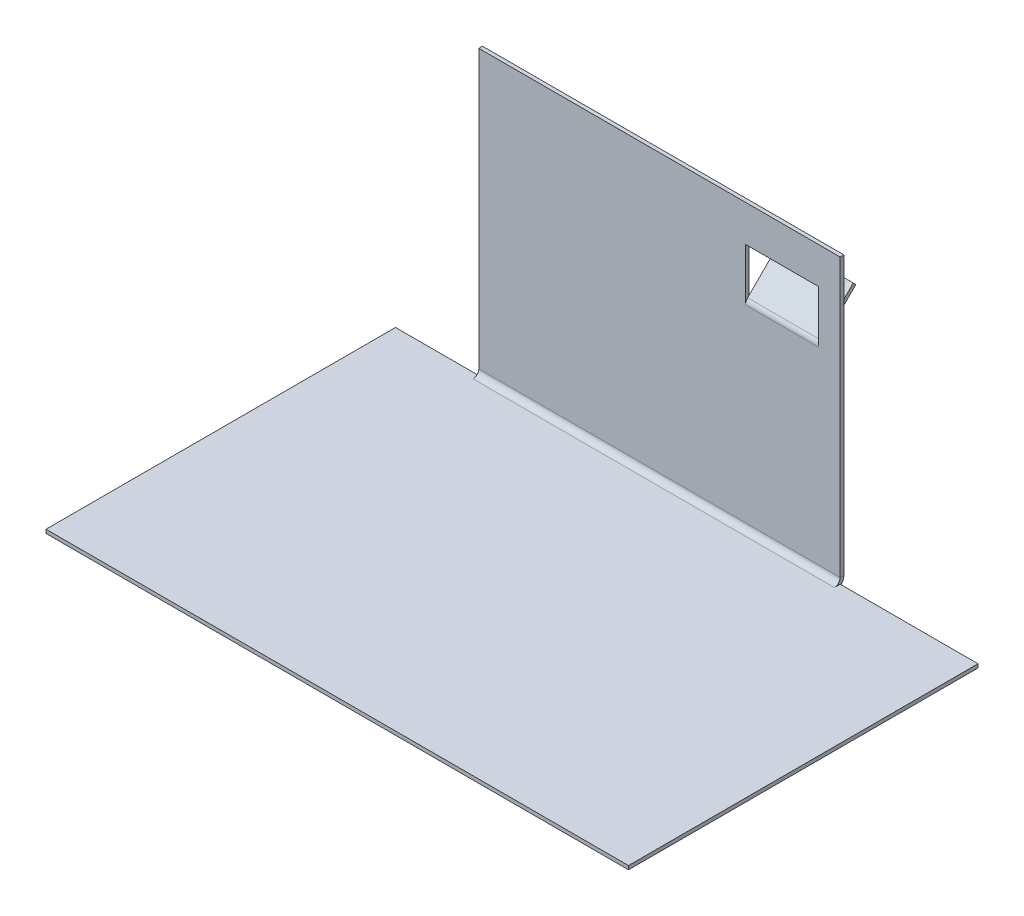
ISO-10303-21;
HEADER;
FILE_DESCRIPTION(('STEP AP214'),'2;1');
FILE_NAME('part.step','',(''),(''),'','','');
FILE_SCHEMA(('AUTOMOTIVE_DESIGN { 1 0 10303 214 1 1 1 1 }'));
ENDSEC;
DATA;
#1=APPLICATION_CONTEXT('core data for automotive mechanical design processes');
#2=APPLICATION_PROTOCOL_DEFINITION('international standard','automotive_design',2000,#1);
#3=PRODUCT_CONTEXT('',#1,'mechanical');
#4=PRODUCT('Part','Part','',(#3));
#5=PRODUCT_RELATED_PRODUCT_CATEGORY('part','',(#4));
#6=PRODUCT_DEFINITION_FORMATION('','',#4);
#7=PRODUCT_DEFINITION_CONTEXT('part definition',#1,'design');
#8=PRODUCT_DEFINITION('design','',#6,#7);
#9=PRODUCT_DEFINITION_SHAPE('','',#8);
#10=(LENGTH_UNIT() NAMED_UNIT(*) SI_UNIT(.MILLI.,.METRE.));
#11=(NAMED_UNIT(*) PLANE_ANGLE_UNIT() SI_UNIT($,.RADIAN.));
#12=(NAMED_UNIT(*) SI_UNIT($,.STERADIAN.) SOLID_ANGLE_UNIT());
#13=UNCERTAINTY_MEASURE_WITH_UNIT(LENGTH_MEASURE(1.E-05),#10,'distance_accuracy_value','');
#14=(GEOMETRIC_REPRESENTATION_CONTEXT(3) GLOBAL_UNCERTAINTY_ASSIGNED_CONTEXT((#13)) GLOBAL_UNIT_ASSIGNED_CONTEXT((#10,
#11,#12)) REPRESENTATION_CONTEXT('',''));
#15=CARTESIAN_POINT('',(0.,0.,0.));
#16=DIRECTION('',(0.,0.,1.));
#17=DIRECTION('',(1.,0.,0.));
#18=AXIS2_PLACEMENT_3D('',#15,#16,#17);
#19=CARTESIAN_POINT('',(0.,-4.15217400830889E-13,-121.27));
#20=DIRECTION('',(0.,0.,1.));
#21=DIRECTION('',(0.,-1.,0.));
#22=AXIS2_PLACEMENT_3D('',#19,#20,#21);
#23=PLANE('',#22);
#24=DIRECTION('',(1.,0.,0.));
#25=VECTOR('',#24,1.);
#26=CARTESIAN_POINT('',(0.,2.,-121.27));
#27=LINE('',#26,#25);
#28=CARTESIAN_POINT('',(28.5988548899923,2.,-121.27));
#29=VERTEX_POINT('',#28);
#30=CARTESIAN_POINT('',(152.672536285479,1.99999999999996,-121.27));
#31=VERTEX_POINT('',#30);
#32=EDGE_CURVE('E258',#29,#31,#27,.T.);
#33=ORIENTED_EDGE('',*,*,#32,.F.);
#34=DIRECTION('',(0.,1.,0.));
#35=VECTOR('',#34,1.);
#36=CARTESIAN_POINT('',(28.5988548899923,97.2971313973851,-121.27));
#37=LINE('',#36,#35);
#38=CARTESIAN_POINT('',(28.5988548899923,97.2971313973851,-121.27));
#39=VERTEX_POINT('',#38);
#40=EDGE_CURVE('E267',#29,#39,#37,.T.);
#41=ORIENTED_EDGE('',*,*,#40,.T.);
#42=DIRECTION('',(1.,0.,0.));
#43=VECTOR('',#42,1.);
#44=CARTESIAN_POINT('',(152.672536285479,97.2971313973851,-121.27));
#45=LINE('',#44,#43);
#46=CARTESIAN_POINT('',(152.672536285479,97.2971313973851,-121.27));
#47=VERTEX_POINT('',#46);
#48=EDGE_CURVE('E270',#39,#47,#45,.T.);
#49=ORIENTED_EDGE('',*,*,#48,.T.);
#50=DIRECTION('',(0.,-1.,0.));
#51=VECTOR('',#50,1.);
#52=CARTESIAN_POINT('',(152.672536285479,0.,-121.27));
#53=LINE('',#52,#51);
#54=EDGE_CURVE('E264',#47,#31,#53,.T.);
#55=ORIENTED_EDGE('',*,*,#54,.T.);
#56=EDGE_LOOP('',(#33,#41,#49,#55));
#57=FACE_BOUND('',#56,.T.);
#58=DIRECTION('',(0.,-1.,0.));
#59=VECTOR('',#58,1.);
#60=CARTESIAN_POINT('',(145.17253628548,-4.15217400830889E-13,-121.27));
#61=LINE('',#60,#59);
#62=CARTESIAN_POINT('',(145.17253628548,69.0818500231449,-121.27));
#63=VERTEX_POINT('',#62);
#64=CARTESIAN_POINT('',(145.17253628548,66.7763161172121,-121.27));
#65=VERTEX_POINT('',#64);
#66=EDGE_CURVE('E215',#63,#65,#61,.T.);
#67=ORIENTED_EDGE('',*,*,#66,.F.);
#68=DIRECTION('',(0.,1.,0.));
#69=VECTOR('',#68,1.);
#70=CARTESIAN_POINT('',(145.17253628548,-4.15217400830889E-13,-121.27));
#71=LINE('',#70,#69);
#72=CARTESIAN_POINT('',(145.17253628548,84.782412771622,-121.27));
#73=VERTEX_POINT('',#72);
#74=EDGE_CURVE('E244',#63,#73,#71,.T.);
#75=ORIENTED_EDGE('',*,*,#74,.T.);
#76=DIRECTION('',(-1.,0.,0.));
#77=VECTOR('',#76,1.);
#78=CARTESIAN_POINT('',(0.,84.782412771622,-121.27));
#79=LINE('',#78,#77);
#80=CARTESIAN_POINT('',(120.17253628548,84.782412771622,-121.27));
#81=VERTEX_POINT('',#80);
#82=EDGE_CURVE('E249',#73,#81,#79,.T.);
#83=ORIENTED_EDGE('',*,*,#82,.T.);
#84=DIRECTION('',(0.,1.,0.));
#85=VECTOR('',#84,1.);
#86=CARTESIAN_POINT('',(120.17253628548,-4.15217400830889E-13,-121.27));
#87=LINE('',#86,#85);
#88=CARTESIAN_POINT('',(120.17253628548,69.0818500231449,-121.27));
#89=VERTEX_POINT('',#88);
#90=EDGE_CURVE('E247',#89,#81,#87,.T.);
#91=ORIENTED_EDGE('',*,*,#90,.F.);
#92=DIRECTION('',(0.,-1.,0.));
#93=VECTOR('',#92,1.);
#94=CARTESIAN_POINT('',(120.17253628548,-4.15217400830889E-13,-121.27));
#95=LINE('',#94,#93);
#96=CARTESIAN_POINT('',(120.17253628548,66.7763161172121,-121.27));
#97=VERTEX_POINT('',#96);
#98=EDGE_CURVE('E195',#97,#89,#95,.F.);
#99=ORIENTED_EDGE('',*,*,#98,.F.);
#100=DIRECTION('',(-1.,0.,0.));
#101=VECTOR('',#100,1.);
#102=CARTESIAN_POINT('',(107.67253628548,66.7763161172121,-121.27));
#103=LINE('',#102,#101);
#104=EDGE_CURVE('E53',#97,#65,#103,.F.);
#105=ORIENTED_EDGE('',*,*,#104,.T.);
#106=EDGE_LOOP('',(#67,#75,#83,#91,#99,#105));
#107=FACE_BOUND('',#106,.T.);
#108=ADVANCED_FACE('F35',(#57,#107),#23,.F.);
#109=CARTESIAN_POINT('',(28.5988548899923,0.,-120.));
#110=DIRECTION('',(1.,0.,0.));
#111=DIRECTION('',(0.,0.,-1.));
#112=AXIS2_PLACEMENT_3D('',#109,#110,#111);
#113=PLANE('',#112);
#114=DIRECTION('',(0.,-1.,0.));
#115=VECTOR('',#114,1.);
#116=CARTESIAN_POINT('',(28.5988548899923,0.,-120.));
#117=LINE('',#116,#115);
#118=CARTESIAN_POINT('',(28.5988548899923,-0.587063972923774,-120.));
#119=VERTEX_POINT('',#118);
#120=CARTESIAN_POINT('',(28.5988548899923,-1.27,-120.));
#121=VERTEX_POINT('',#120);
#122=EDGE_CURVE('E311',#119,#121,#117,.T.);
#123=ORIENTED_EDGE('',*,*,#122,.F.);
#124=CARTESIAN_POINT('',(28.5988548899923,1.99999999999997,-118.));
#125=DIRECTION('',(-1.,0.,0.));
#126=DIRECTION('',(0.,0.,1.));
#127=AXIS2_PLACEMENT_3D('',#124,#125,#126);
#128=CIRCLE('',#127,3.27);
#129=CARTESIAN_POINT('',(28.5988548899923,-1.27,-118.));
#130=VERTEX_POINT('',#129);
#131=EDGE_CURVE('E12',#119,#130,#128,.T.);
#132=ORIENTED_EDGE('',*,*,#131,.T.);
#133=DIRECTION('',(0.,0.,1.));
#134=VECTOR('',#133,1.);
#135=CARTESIAN_POINT('',(28.5988548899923,-1.27,0.));
#136=LINE('',#135,#134);
#137=EDGE_CURVE('E316',#121,#130,#136,.T.);
#138=ORIENTED_EDGE('',*,*,#137,.F.);
#139=EDGE_LOOP('',(#123,#132,#138));
#140=FACE_BOUND('',#139,.T.);
#141=ADVANCED_FACE('F410',(#140),#113,.T.);
#142=CARTESIAN_POINT('',(152.672536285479,0.,-118.));
#143=DIRECTION('',(-1.,0.,0.));
#144=DIRECTION('',(0.,0.,1.));
#145=AXIS2_PLACEMENT_3D('',#142,#143,#144);
#146=PLANE('',#145);
#147=DIRECTION('',(0.,0.,-1.));
#148=VECTOR('',#147,1.);
#149=CARTESIAN_POINT('',(152.672536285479,-1.27,0.));
#150=LINE('',#149,#148);
#151=CARTESIAN_POINT('',(152.672536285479,-1.27,-118.));
#152=VERTEX_POINT('',#151);
#153=CARTESIAN_POINT('',(152.672536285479,-1.27,-120.));
#154=VERTEX_POINT('',#153);
#155=EDGE_CURVE('E303',#152,#154,#150,.T.);
#156=ORIENTED_EDGE('',*,*,#155,.F.);
#157=CARTESIAN_POINT('',(152.672536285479,1.99999999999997,-118.));
#158=DIRECTION('',(-1.,0.,0.));
#159=DIRECTION('',(0.,0.,1.));
#160=AXIS2_PLACEMENT_3D('',#157,#158,#159);
#161=CIRCLE('',#160,3.27);
#162=CARTESIAN_POINT('',(152.672536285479,-0.587063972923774,-120.));
#163=VERTEX_POINT('',#162);
#164=EDGE_CURVE('E287',#152,#163,#161,.F.);
#165=ORIENTED_EDGE('',*,*,#164,.T.);
#166=DIRECTION('',(0.,-1.,0.));
#167=VECTOR('',#166,1.);
#168=CARTESIAN_POINT('',(152.672536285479,0.,-120.));
#169=LINE('',#168,#167);
#170=EDGE_CURVE('E307',#163,#154,#169,.T.);
#171=ORIENTED_EDGE('',*,*,#170,.T.);
#172=EDGE_LOOP('',(#156,#165,#171));
#173=FACE_BOUND('',#172,.T.);
#174=ADVANCED_FACE('F413',(#173),#146,.T.);
#175=CARTESIAN_POINT('',(0.,-1.27,-120.));
#176=DIRECTION('',(0.,0.,-1.));
#177=DIRECTION('',(-1.,0.,0.));
#178=AXIS2_PLACEMENT_3D('',#175,#176,#177);
#179=PLANE('',#178);
#180=DIRECTION('',(-1.,0.,0.));
#181=VECTOR('',#180,1.);
#182=CARTESIAN_POINT('',(0.,0.,-120.));
#183=LINE('',#182,#181);
#184=CARTESIAN_POINT('',(28.5988548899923,0.,-120.));
#185=VERTEX_POINT('',#184);
#186=CARTESIAN_POINT('',(0.,0.,-120.));
#187=VERTEX_POINT('',#186);
#188=EDGE_CURVE('E342',#185,#187,#183,.T.);
#189=ORIENTED_EDGE('',*,*,#188,.F.);
#190=EDGE_CURVE('E304',#185,#119,#117,.T.);
#191=ORIENTED_EDGE('',*,*,#190,.T.);
#192=ORIENTED_EDGE('',*,*,#122,.T.);
#193=DIRECTION('',(-1.,0.,0.));
#194=VECTOR('',#193,1.);
#195=CARTESIAN_POINT('',(0.,-1.27,-120.));
#196=LINE('',#195,#194);
#197=CARTESIAN_POINT('',(0.,-1.27,-120.));
#198=VERTEX_POINT('',#197);
#199=EDGE_CURVE('E330',#121,#198,#196,.T.);
#200=ORIENTED_EDGE('',*,*,#199,.T.);
#201=DIRECTION('',(0.,1.,0.));
#202=VECTOR('',#201,1.);
#203=CARTESIAN_POINT('',(0.,-1.27,-120.));
#204=LINE('',#203,#202);
#205=EDGE_CURVE('E44',#198,#187,#204,.T.);
#206=ORIENTED_EDGE('',*,*,#205,.T.);
#207=EDGE_LOOP('',(#189,#191,#192,#200,#206));
#208=FACE_BOUND('',#207,.T.);
#209=ADVANCED_FACE('F362',(#208),#179,.T.);
#210=CARTESIAN_POINT('',(200.,-1.27,-120.));
#211=VERTEX_POINT('',#210);
#212=EDGE_CURVE('E331',#211,#154,#196,.T.);
#213=ORIENTED_EDGE('',*,*,#212,.T.);
#214=ORIENTED_EDGE('',*,*,#170,.F.);
#215=CARTESIAN_POINT('',(152.672536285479,0.,-120.));
#216=VERTEX_POINT('',#215);
#217=EDGE_CURVE('E308',#216,#163,#169,.T.);
#218=ORIENTED_EDGE('',*,*,#217,.F.);
#219=CARTESIAN_POINT('',(200.,0.,-120.));
#220=VERTEX_POINT('',#219);
#221=EDGE_CURVE('E324',#220,#216,#183,.T.);
#222=ORIENTED_EDGE('',*,*,#221,.F.);
#223=DIRECTION('',(0.,1.,0.));
#224=VECTOR('',#223,1.);
#225=CARTESIAN_POINT('',(200.,-1.27,-120.));
#226=LINE('',#225,#224);
#227=EDGE_CURVE('E346',#211,#220,#226,.T.);
#228=ORIENTED_EDGE('',*,*,#227,.F.);
#229=EDGE_LOOP('',(#213,#214,#218,#222,#228));
#230=FACE_BOUND('',#229,.T.);
#231=ADVANCED_FACE('F374',(#230),#179,.T.);
#232=CARTESIAN_POINT('',(0.,-1.27,0.));
#233=DIRECTION('',(0.,-1.,0.));
#234=DIRECTION('',(0.,0.,-1.));
#235=AXIS2_PLACEMENT_3D('',#232,#233,#234);
#236=PLANE('',#235);
#237=ORIENTED_EDGE('',*,*,#199,.F.);
#238=ORIENTED_EDGE('',*,*,#137,.T.);
#239=DIRECTION('',(-1.,0.,0.));
#240=VECTOR('',#239,1.);
#241=CARTESIAN_POINT('',(28.5988548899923,-1.27000000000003,-118.));
#242=LINE('',#241,#240);
#243=EDGE_CURVE('E284',#130,#152,#242,.F.);
#244=ORIENTED_EDGE('',*,*,#243,.T.);
#245=ORIENTED_EDGE('',*,*,#155,.T.);
#246=ORIENTED_EDGE('',*,*,#212,.F.);
#247=DIRECTION('',(0.,0.,-1.));
#248=VECTOR('',#247,1.);
#249=CARTESIAN_POINT('',(200.,-1.27,0.));
#250=LINE('',#249,#248);
#251=CARTESIAN_POINT('',(200.,-1.27,0.));
#252=VERTEX_POINT('',#251);
#253=EDGE_CURVE('E327',#252,#211,#250,.T.);
#254=ORIENTED_EDGE('',*,*,#253,.F.);
#255=DIRECTION('',(1.,0.,0.));
#256=VECTOR('',#255,1.);
#257=CARTESIAN_POINT('',(0.,-1.27,0.));
#258=LINE('',#257,#256);
#259=CARTESIAN_POINT('',(0.,-1.27,0.));
#260=VERTEX_POINT('',#259);
#261=EDGE_CURVE('E323',#260,#252,#258,.T.);
#262=ORIENTED_EDGE('',*,*,#261,.F.);
#263=DIRECTION('',(0.,0.,1.));
#264=VECTOR('',#263,1.);
#265=CARTESIAN_POINT('',(0.,-1.27,0.));
#266=LINE('',#265,#264);
#267=EDGE_CURVE('E320',#198,#260,#266,.T.);
#268=ORIENTED_EDGE('',*,*,#267,.F.);
#269=EDGE_LOOP('',(#237,#238,#244,#245,#246,#254,#262,#268));
#270=FACE_BOUND('',#269,.T.);
#271=ADVANCED_FACE('F365',(#270),#236,.T.);
#272=CARTESIAN_POINT('',(0.,0.,0.));
#273=DIRECTION('',(0.,-1.,0.));
#274=DIRECTION('',(0.,0.,-1.));
#275=AXIS2_PLACEMENT_3D('',#272,#273,#274);
#276=PLANE('',#275);
#277=DIRECTION('',(0.,0.,1.));
#278=VECTOR('',#277,1.);
#279=CARTESIAN_POINT('',(28.5988548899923,0.,-120.));
#280=LINE('',#279,#278);
#281=CARTESIAN_POINT('',(28.5988548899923,0.,-118.));
#282=VERTEX_POINT('',#281);
#283=EDGE_CURVE('E300',#185,#282,#280,.T.);
#284=ORIENTED_EDGE('',*,*,#283,.F.);
#285=ORIENTED_EDGE('',*,*,#188,.T.);
#286=DIRECTION('',(0.,0.,1.));
#287=VECTOR('',#286,1.);
#288=CARTESIAN_POINT('',(0.,0.,0.));
#289=LINE('',#288,#287);
#290=CARTESIAN_POINT('',(0.,0.,0.));
#291=VERTEX_POINT('',#290);
#292=EDGE_CURVE('E319',#187,#291,#289,.T.);
#293=ORIENTED_EDGE('',*,*,#292,.T.);
#294=DIRECTION('',(1.,0.,0.));
#295=VECTOR('',#294,1.);
#296=CARTESIAN_POINT('',(0.,0.,0.));
#297=LINE('',#296,#295);
#298=CARTESIAN_POINT('',(200.,0.,0.));
#299=VERTEX_POINT('',#298);
#300=EDGE_CURVE('E336',#291,#299,#297,.T.);
#301=ORIENTED_EDGE('',*,*,#300,.T.);
#302=DIRECTION('',(0.,0.,-1.));
#303=VECTOR('',#302,1.);
#304=CARTESIAN_POINT('',(200.,0.,0.));
#305=LINE('',#304,#303);
#306=EDGE_CURVE('E339',#299,#220,#305,.T.);
#307=ORIENTED_EDGE('',*,*,#306,.T.);
#308=ORIENTED_EDGE('',*,*,#221,.T.);
#309=DIRECTION('',(0.,0.,-1.));
#310=VECTOR('',#309,1.);
#311=CARTESIAN_POINT('',(152.672536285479,0.,-118.));
#312=LINE('',#311,#310);
#313=CARTESIAN_POINT('',(152.672536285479,0.,-118.));
#314=VERTEX_POINT('',#313);
#315=EDGE_CURVE('E289',#314,#216,#312,.T.);
#316=ORIENTED_EDGE('',*,*,#315,.F.);
#317=DIRECTION('',(-1.,0.,0.));
#318=VECTOR('',#317,1.);
#319=CARTESIAN_POINT('',(28.5988548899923,0.,-118.));
#320=LINE('',#319,#318);
#321=EDGE_CURVE('E295',#282,#314,#320,.F.);
#322=ORIENTED_EDGE('',*,*,#321,.F.);
#323=EDGE_LOOP('',(#284,#285,#293,#301,#307,#308,#316,#322));
#324=FACE_BOUND('',#323,.T.);
#325=ADVANCED_FACE('F358',(#324),#276,.F.);
#326=CARTESIAN_POINT('',(0.,-1.27,0.));
#327=DIRECTION('',(-1.,0.,0.));
#328=DIRECTION('',(0.,0.,1.));
#329=AXIS2_PLACEMENT_3D('',#326,#327,#328);
#330=PLANE('',#329);
#331=ORIENTED_EDGE('',*,*,#292,.F.);
#332=ORIENTED_EDGE('',*,*,#205,.F.);
#333=ORIENTED_EDGE('',*,*,#267,.T.);
#334=DIRECTION('',(0.,1.,0.));
#335=VECTOR('',#334,1.);
#336=CARTESIAN_POINT('',(0.,-1.27,0.));
#337=LINE('',#336,#335);
#338=EDGE_CURVE('E39',#260,#291,#337,.T.);
#339=ORIENTED_EDGE('',*,*,#338,.T.);
#340=EDGE_LOOP('',(#331,#332,#333,#339));
#341=FACE_BOUND('',#340,.T.);
#342=ADVANCED_FACE('F37',(#341),#330,.T.);
#343=CARTESIAN_POINT('',(200.,-1.27,0.));
#344=DIRECTION('',(1.,0.,0.));
#345=DIRECTION('',(0.,0.,-1.));
#346=AXIS2_PLACEMENT_3D('',#343,#344,#345);
#347=PLANE('',#346);
#348=ORIENTED_EDGE('',*,*,#306,.F.);
#349=DIRECTION('',(0.,1.,0.));
#350=VECTOR('',#349,1.);
#351=CARTESIAN_POINT('',(200.,-1.27,0.));
#352=LINE('',#351,#350);
#353=EDGE_CURVE('E347',#252,#299,#352,.T.);
#354=ORIENTED_EDGE('',*,*,#353,.F.);
#355=ORIENTED_EDGE('',*,*,#253,.T.);
#356=ORIENTED_EDGE('',*,*,#227,.T.);
#357=EDGE_LOOP('',(#348,#354,#355,#356));
#358=FACE_BOUND('',#357,.T.);
#359=ADVANCED_FACE('F370',(#358),#347,.T.);
#360=CARTESIAN_POINT('',(0.,-1.27,0.));
#361=DIRECTION('',(0.,0.,1.));
#362=DIRECTION('',(1.,0.,0.));
#363=AXIS2_PLACEMENT_3D('',#360,#361,#362);
#364=PLANE('',#363);
#365=ORIENTED_EDGE('',*,*,#300,.F.);
#366=ORIENTED_EDGE('',*,*,#338,.F.);
#367=ORIENTED_EDGE('',*,*,#261,.T.);
#368=ORIENTED_EDGE('',*,*,#353,.T.);
#369=EDGE_LOOP('',(#365,#366,#367,#368));
#370=FACE_BOUND('',#369,.T.);
#371=ADVANCED_FACE('F356',(#370),#364,.T.);
#372=CARTESIAN_POINT('',(28.5988548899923,1.99999999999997,-118.));
#373=DIRECTION('',(1.,0.,0.));
#374=DIRECTION('',(0.,0.,-1.));
#375=AXIS2_PLACEMENT_3D('',#372,#373,#374);
#376=PLANE('',#375);
#377=ORIENTED_EDGE('',*,*,#190,.F.);
#378=ORIENTED_EDGE('',*,*,#283,.T.);
#379=CARTESIAN_POINT('',(28.5988548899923,1.99999999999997,-118.));
#380=DIRECTION('',(-1.,0.,0.));
#381=DIRECTION('',(0.,0.,1.));
#382=AXIS2_PLACEMENT_3D('',#379,#380,#381);
#383=CIRCLE('',#382,2.);
#384=CARTESIAN_POINT('',(28.5988548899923,1.99999999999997,-120.));
#385=VERTEX_POINT('',#384);
#386=EDGE_CURVE('E283',#385,#282,#383,.T.);
#387=ORIENTED_EDGE('',*,*,#386,.F.);
#388=DIRECTION('',(0.,0.,-1.));
#389=VECTOR('',#388,1.);
#390=CARTESIAN_POINT('',(28.5988548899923,1.99999999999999,-120.));
#391=LINE('',#390,#389);
#392=EDGE_CURVE('E255',#385,#29,#391,.T.);
#393=ORIENTED_EDGE('',*,*,#392,.T.);
#394=EDGE_CURVE('E46',#29,#119,#128,.T.);
#395=ORIENTED_EDGE('',*,*,#394,.T.);
#396=EDGE_LOOP('',(#377,#378,#387,#393,#395));
#397=FACE_BOUND('',#396,.T.);
#398=ADVANCED_FACE('F385',(#397),#376,.F.);
#399=CARTESIAN_POINT('',(152.672536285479,1.99999999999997,-118.));
#400=DIRECTION('',(1.,0.,0.));
#401=DIRECTION('',(0.,0.,-1.));
#402=AXIS2_PLACEMENT_3D('',#399,#400,#401);
#403=PLANE('',#402);
#404=CARTESIAN_POINT('',(152.672536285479,1.99999999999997,-118.));
#405=DIRECTION('',(-1.,0.,0.));
#406=DIRECTION('',(0.,0.,1.));
#407=AXIS2_PLACEMENT_3D('',#404,#405,#406);
#408=CIRCLE('',#407,2.);
#409=CARTESIAN_POINT('',(152.672536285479,1.99999999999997,-120.));
#410=VERTEX_POINT('',#409);
#411=EDGE_CURVE('E292',#314,#410,#408,.F.);
#412=ORIENTED_EDGE('',*,*,#411,.F.);
#413=ORIENTED_EDGE('',*,*,#315,.T.);
#414=ORIENTED_EDGE('',*,*,#217,.T.);
#415=EDGE_CURVE('E286',#163,#31,#161,.F.);
#416=ORIENTED_EDGE('',*,*,#415,.T.);
#417=DIRECTION('',(0.,0.,-1.));
#418=VECTOR('',#417,1.);
#419=CARTESIAN_POINT('',(152.672536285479,1.99999999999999,-120.));
#420=LINE('',#419,#418);
#421=EDGE_CURVE('E252',#410,#31,#420,.T.);
#422=ORIENTED_EDGE('',*,*,#421,.F.);
#423=EDGE_LOOP('',(#412,#413,#414,#416,#422));
#424=FACE_BOUND('',#423,.T.);
#425=ADVANCED_FACE('F378',(#424),#403,.T.);
#426=CARTESIAN_POINT('',(28.5988548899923,1.99999999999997,-118.));
#427=DIRECTION('',(-1.,0.,0.));
#428=DIRECTION('',(0.,0.,-1.));
#429=AXIS2_PLACEMENT_3D('',#426,#427,#428);
#430=CYLINDRICAL_SURFACE('',#429,3.27);
#431=ORIENTED_EDGE('',*,*,#243,.F.);
#432=ORIENTED_EDGE('',*,*,#131,.F.);
#433=ORIENTED_EDGE('',*,*,#394,.F.);
#434=ORIENTED_EDGE('',*,*,#32,.T.);
#435=ORIENTED_EDGE('',*,*,#415,.F.);
#436=ORIENTED_EDGE('',*,*,#164,.F.);
#437=EDGE_LOOP('',(#431,#432,#433,#434,#435,#436));
#438=FACE_BOUND('',#437,.T.);
#439=ADVANCED_FACE('F406',(#438),#430,.T.);
#440=CARTESIAN_POINT('',(28.5988548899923,1.99999999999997,-118.));
#441=DIRECTION('',(-1.,0.,0.));
#442=DIRECTION('',(0.,0.,-1.));
#443=AXIS2_PLACEMENT_3D('',#440,#441,#442);
#444=CYLINDRICAL_SURFACE('',#443,2.);
#445=ORIENTED_EDGE('',*,*,#321,.T.);
#446=ORIENTED_EDGE('',*,*,#411,.T.);
#447=DIRECTION('',(-1.,0.,0.));
#448=VECTOR('',#447,1.);
#449=CARTESIAN_POINT('',(152.672536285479,1.99999999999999,-120.));
#450=LINE('',#449,#448);
#451=EDGE_CURVE('E253',#410,#385,#450,.T.);
#452=ORIENTED_EDGE('',*,*,#451,.T.);
#453=ORIENTED_EDGE('',*,*,#386,.T.);
#454=EDGE_LOOP('',(#445,#446,#452,#453));
#455=FACE_BOUND('',#454,.T.);
#456=ADVANCED_FACE('F380',(#455),#444,.F.);
#457=CARTESIAN_POINT('',(152.672536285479,0.,-121.27));
#458=DIRECTION('',(-1.,0.,0.));
#459=DIRECTION('',(0.,0.,1.));
#460=AXIS2_PLACEMENT_3D('',#457,#458,#459);
#461=PLANE('',#460);
#462=ORIENTED_EDGE('',*,*,#421,.T.);
#463=ORIENTED_EDGE('',*,*,#54,.F.);
#464=DIRECTION('',(0.,0.,1.));
#465=VECTOR('',#464,1.);
#466=CARTESIAN_POINT('',(152.672536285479,97.2971313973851,-121.27));
#467=LINE('',#466,#465);
#468=CARTESIAN_POINT('',(152.672536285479,97.2971313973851,-120.));
#469=VERTEX_POINT('',#468);
#470=EDGE_CURVE('E272',#47,#469,#467,.T.);
#471=ORIENTED_EDGE('',*,*,#470,.T.);
#472=DIRECTION('',(0.,-1.,0.));
#473=VECTOR('',#472,1.);
#474=CARTESIAN_POINT('',(152.672536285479,0.,-120.));
#475=LINE('',#474,#473);
#476=EDGE_CURVE('E263',#469,#410,#475,.T.);
#477=ORIENTED_EDGE('',*,*,#476,.T.);
#478=EDGE_LOOP('',(#462,#463,#471,#477));
#479=FACE_BOUND('',#478,.T.);
#480=ADVANCED_FACE('F402',(#479),#461,.F.);
#481=CARTESIAN_POINT('',(28.5988548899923,97.2971313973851,-121.27));
#482=DIRECTION('',(1.,0.,0.));
#483=DIRECTION('',(0.,0.,-1.));
#484=AXIS2_PLACEMENT_3D('',#481,#482,#483);
#485=PLANE('',#484);
#486=ORIENTED_EDGE('',*,*,#392,.F.);
#487=DIRECTION('',(0.,1.,0.));
#488=VECTOR('',#487,1.);
#489=CARTESIAN_POINT('',(28.5988548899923,97.2971313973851,-120.));
#490=LINE('',#489,#488);
#491=CARTESIAN_POINT('',(28.5988548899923,97.2971313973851,-120.));
#492=VERTEX_POINT('',#491);
#493=EDGE_CURVE('E275',#385,#492,#490,.T.);
#494=ORIENTED_EDGE('',*,*,#493,.T.);
#495=DIRECTION('',(0.,0.,1.));
#496=VECTOR('',#495,1.);
#497=CARTESIAN_POINT('',(28.5988548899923,97.2971313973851,-121.27));
#498=LINE('',#497,#496);
#499=EDGE_CURVE('E280',#39,#492,#498,.T.);
#500=ORIENTED_EDGE('',*,*,#499,.F.);
#501=ORIENTED_EDGE('',*,*,#40,.F.);
#502=EDGE_LOOP('',(#486,#494,#500,#501));
#503=FACE_BOUND('',#502,.T.);
#504=ADVANCED_FACE('F390',(#503),#485,.F.);
#505=CARTESIAN_POINT('',(0.,-4.10783219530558E-13,-120.));
#506=DIRECTION('',(0.,0.,1.));
#507=DIRECTION('',(0.,-1.,0.));
#508=AXIS2_PLACEMENT_3D('',#505,#506,#507);
#509=PLANE('',#508);
#510=DIRECTION('',(1.,0.,0.));
#511=VECTOR('',#510,1.);
#512=CARTESIAN_POINT('',(120.17253628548,84.782412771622,-120.));
#513=LINE('',#512,#511);
#514=CARTESIAN_POINT('',(120.17253628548,84.782412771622,-120.));
#515=VERTEX_POINT('',#514);
#516=CARTESIAN_POINT('',(145.17253628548,84.782412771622,-120.));
#517=VERTEX_POINT('',#516);
#518=EDGE_CURVE('E230',#515,#517,#513,.T.);
#519=ORIENTED_EDGE('',*,*,#518,.T.);
#520=DIRECTION('',(0.,1.,0.));
#521=VECTOR('',#520,1.);
#522=CARTESIAN_POINT('',(145.17253628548,67.8118500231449,-120.));
#523=LINE('',#522,#521);
#524=CARTESIAN_POINT('',(145.17253628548,66.7763161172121,-120.));
#525=VERTEX_POINT('',#524);
#526=EDGE_CURVE('E225',#525,#517,#523,.T.);
#527=ORIENTED_EDGE('',*,*,#526,.F.);
#528=DIRECTION('',(1.,0.,0.));
#529=VECTOR('',#528,1.);
#530=CARTESIAN_POINT('',(145.17253628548,66.7763161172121,-120.));
#531=LINE('',#530,#529);
#532=CARTESIAN_POINT('',(120.17253628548,66.7763161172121,-120.));
#533=VERTEX_POINT('',#532);
#534=EDGE_CURVE('E236',#533,#525,#531,.T.);
#535=ORIENTED_EDGE('',*,*,#534,.F.);
#536=DIRECTION('',(0.,1.,0.));
#537=VECTOR('',#536,1.);
#538=CARTESIAN_POINT('',(120.17253628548,67.8118500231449,-120.));
#539=LINE('',#538,#537);
#540=EDGE_CURVE('E227',#533,#515,#539,.T.);
#541=ORIENTED_EDGE('',*,*,#540,.T.);
#542=EDGE_LOOP('',(#519,#527,#535,#541));
#543=FACE_BOUND('',#542,.T.);
#544=ORIENTED_EDGE('',*,*,#493,.F.);
#545=ORIENTED_EDGE('',*,*,#451,.F.);
#546=ORIENTED_EDGE('',*,*,#476,.F.);
#547=DIRECTION('',(1.,0.,0.));
#548=VECTOR('',#547,1.);
#549=CARTESIAN_POINT('',(152.672536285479,97.2971313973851,-120.));
#550=LINE('',#549,#548);
#551=EDGE_CURVE('E268',#492,#469,#550,.T.);
#552=ORIENTED_EDGE('',*,*,#551,.F.);
#553=EDGE_LOOP('',(#544,#545,#546,#552));
#554=FACE_BOUND('',#553,.T.);
#555=ADVANCED_FACE('F394',(#543,#554),#509,.T.);
#556=CARTESIAN_POINT('',(152.672536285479,97.2971313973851,-121.27));
#557=DIRECTION('',(0.,-1.,0.));
#558=DIRECTION('',(0.,0.,-1.));
#559=AXIS2_PLACEMENT_3D('',#556,#557,#558);
#560=PLANE('',#559);
#561=ORIENTED_EDGE('',*,*,#551,.T.);
#562=ORIENTED_EDGE('',*,*,#470,.F.);
#563=ORIENTED_EDGE('',*,*,#48,.F.);
#564=ORIENTED_EDGE('',*,*,#499,.T.);
#565=EDGE_LOOP('',(#561,#562,#563,#564));
#566=FACE_BOUND('',#565,.T.);
#567=ADVANCED_FACE('F398',(#566),#560,.F.);
#568=CARTESIAN_POINT('',(120.17253628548,67.8118500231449,-120.));
#569=DIRECTION('',(0.,-0.707106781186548,-0.707106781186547));
#570=DIRECTION('',(0.,-0.707106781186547,0.707106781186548));
#571=AXIS2_PLACEMENT_3D('',#568,#569,#570);
#572=PLANE('',#571);
#573=DIRECTION('',(0.,0.707106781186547,-0.707106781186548));
#574=VECTOR('',#573,1.);
#575=CARTESIAN_POINT('',(120.17253628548,67.8118500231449,-120.));
#576=LINE('',#575,#574);
#577=CARTESIAN_POINT('',(120.17253628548,68.5440830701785,-120.732233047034));
#578=VERTEX_POINT('',#577);
#579=EDGE_CURVE('E222',#578,#89,#576,.T.);
#580=ORIENTED_EDGE('',*,*,#579,.F.);
#581=DIRECTION('',(1.,0.,0.));
#582=VECTOR('',#581,1.);
#583=CARTESIAN_POINT('',(120.17253628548,68.5440830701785,-120.732233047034));
#584=LINE('',#583,#582);
#585=CARTESIAN_POINT('',(145.17253628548,68.5440830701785,-120.732233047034));
#586=VERTEX_POINT('',#585);
#587=EDGE_CURVE('E238',#586,#578,#584,.F.);
#588=ORIENTED_EDGE('',*,*,#587,.F.);
#589=DIRECTION('',(0.,0.707106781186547,-0.707106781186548));
#590=VECTOR('',#589,1.);
#591=CARTESIAN_POINT('',(145.17253628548,67.8118500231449,-120.));
#592=LINE('',#591,#590);
#593=EDGE_CURVE('E221',#586,#63,#592,.T.);
#594=ORIENTED_EDGE('',*,*,#593,.T.);
#595=DIRECTION('',(0.,0.707106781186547,-0.707106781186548));
#596=VECTOR('',#595,1.);
#597=CARTESIAN_POINT('',(145.17253628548,67.8118500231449,-120.));
#598=LINE('',#597,#596);
#599=CARTESIAN_POINT('',(145.17253628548,79.8118500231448,-132.));
#600=VERTEX_POINT('',#599);
#601=EDGE_CURVE('E199',#63,#600,#598,.T.);
#602=ORIENTED_EDGE('',*,*,#601,.T.);
#603=DIRECTION('',(1.,0.,0.));
#604=VECTOR('',#603,1.);
#605=CARTESIAN_POINT('',(120.17253628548,79.8118500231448,-132.));
#606=LINE('',#605,#604);
#607=CARTESIAN_POINT('',(120.17253628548,79.8118500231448,-132.));
#608=VERTEX_POINT('',#607);
#609=EDGE_CURVE('E198',#608,#600,#606,.T.);
#610=ORIENTED_EDGE('',*,*,#609,.F.);
#611=DIRECTION('',(0.,0.707106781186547,-0.707106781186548));
#612=VECTOR('',#611,1.);
#613=CARTESIAN_POINT('',(120.17253628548,67.8118500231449,-120.));
#614=LINE('',#613,#612);
#615=EDGE_CURVE('E188',#89,#608,#614,.T.);
#616=ORIENTED_EDGE('',*,*,#615,.F.);
#617=EDGE_LOOP('',(#580,#588,#594,#602,#610,#616));
#618=FACE_BOUND('',#617,.T.);
#619=ADVANCED_FACE('F202',(#618),#572,.F.);
#620=CARTESIAN_POINT('',(120.17253628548,84.782412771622,-132.));
#621=DIRECTION('',(0.,1.,0.));
#622=DIRECTION('',(0.,0.,-1.));
#623=AXIS2_PLACEMENT_3D('',#620,#621,#622);
#624=PLANE('',#623);
#625=DIRECTION('',(0.,0.,1.));
#626=VECTOR('',#625,1.);
#627=CARTESIAN_POINT('',(145.17253628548,84.782412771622,-132.));
#628=LINE('',#627,#626);
#629=EDGE_CURVE('E61',#73,#517,#628,.T.);
#630=ORIENTED_EDGE('',*,*,#629,.T.);
#631=ORIENTED_EDGE('',*,*,#518,.F.);
#632=DIRECTION('',(0.,0.,1.));
#633=VECTOR('',#632,1.);
#634=CARTESIAN_POINT('',(120.17253628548,84.782412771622,-132.));
#635=LINE('',#634,#633);
#636=EDGE_CURVE('E224',#81,#515,#635,.T.);
#637=ORIENTED_EDGE('',*,*,#636,.F.);
#638=ORIENTED_EDGE('',*,*,#82,.F.);
#639=EDGE_LOOP('',(#630,#631,#637,#638));
#640=FACE_BOUND('',#639,.T.);
#641=ADVANCED_FACE('F574',(#640),#624,.F.);
#642=CARTESIAN_POINT('',(120.17253628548,67.8118500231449,-120.));
#643=DIRECTION('',(1.,0.,0.));
#644=DIRECTION('',(0.,1.,0.));
#645=AXIS2_PLACEMENT_3D('',#642,#643,#644);
#646=PLANE('',#645);
#647=ORIENTED_EDGE('',*,*,#90,.T.);
#648=ORIENTED_EDGE('',*,*,#636,.T.);
#649=ORIENTED_EDGE('',*,*,#540,.F.);
#650=CARTESIAN_POINT('',(120.17253628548,66.7763161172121,-122.5));
#651=DIRECTION('',(1.,0.,0.));
#652=DIRECTION('',(0.,1.,0.));
#653=AXIS2_PLACEMENT_3D('',#650,#651,#652);
#654=CIRCLE('',#653,2.5);
#655=EDGE_CURVE('E242',#578,#533,#654,.T.);
#656=ORIENTED_EDGE('',*,*,#655,.F.);
#657=ORIENTED_EDGE('',*,*,#579,.T.);
#658=EDGE_LOOP('',(#647,#648,#649,#656,#657));
#659=FACE_BOUND('',#658,.T.);
#660=ADVANCED_FACE('F582',(#659),#646,.T.);
#661=CARTESIAN_POINT('',(145.17253628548,67.8118500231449,-120.));
#662=DIRECTION('',(1.,0.,0.));
#663=DIRECTION('',(0.,1.,0.));
#664=AXIS2_PLACEMENT_3D('',#661,#662,#663);
#665=PLANE('',#664);
#666=ORIENTED_EDGE('',*,*,#593,.F.);
#667=CARTESIAN_POINT('',(145.17253628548,66.7763161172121,-122.5));
#668=DIRECTION('',(1.,0.,0.));
#669=DIRECTION('',(0.,1.,0.));
#670=AXIS2_PLACEMENT_3D('',#667,#668,#669);
#671=CIRCLE('',#670,2.5);
#672=EDGE_CURVE('E240',#525,#586,#671,.F.);
#673=ORIENTED_EDGE('',*,*,#672,.F.);
#674=ORIENTED_EDGE('',*,*,#526,.T.);
#675=ORIENTED_EDGE('',*,*,#629,.F.);
#676=ORIENTED_EDGE('',*,*,#74,.F.);
#677=EDGE_LOOP('',(#666,#673,#674,#675,#676));
#678=FACE_BOUND('',#677,.T.);
#679=ADVANCED_FACE('F592',(#678),#665,.F.);
#680=CARTESIAN_POINT('',(107.67253628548,66.7763161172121,-122.5));
#681=DIRECTION('',(-1.,0.,0.));
#682=DIRECTION('',(0.,-1.,0.));
#683=AXIS2_PLACEMENT_3D('',#680,#681,#682);
#684=CYLINDRICAL_SURFACE('',#683,2.5);
#685=ORIENTED_EDGE('',*,*,#655,.T.);
#686=ORIENTED_EDGE('',*,*,#534,.T.);
#687=ORIENTED_EDGE('',*,*,#672,.T.);
#688=ORIENTED_EDGE('',*,*,#587,.T.);
#689=EDGE_LOOP('',(#685,#686,#687,#688));
#690=FACE_BOUND('',#689,.T.);
#691=ADVANCED_FACE('F429',(#690),#684,.T.);
#692=CARTESIAN_POINT('',(145.17253628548,66.7763161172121,-122.5));
#693=DIRECTION('',(-1.,0.,0.));
#694=DIRECTION('',(0.,0.,1.));
#695=AXIS2_PLACEMENT_3D('',#692,#693,#694);
#696=PLANE('',#695);
#697=ORIENTED_EDGE('',*,*,#601,.F.);
#698=ORIENTED_EDGE('',*,*,#66,.T.);
#699=CARTESIAN_POINT('',(145.17253628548,66.7763161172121,-122.5));
#700=DIRECTION('',(-1.,0.,0.));
#701=DIRECTION('',(0.,0.,1.));
#702=AXIS2_PLACEMENT_3D('',#699,#700,#701);
#703=CIRCLE('',#702,1.23);
#704=CARTESIAN_POINT('',(145.17253628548,67.6460574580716,-121.630258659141));
#705=VERTEX_POINT('',#704);
#706=EDGE_CURVE('E670',#65,#705,#703,.T.);
#707=ORIENTED_EDGE('',*,*,#706,.T.);
#708=DIRECTION('',(0.,-0.707106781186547,0.707106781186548));
#709=VECTOR('',#708,1.);
#710=CARTESIAN_POINT('',(145.17253628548,66.913824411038,-120.898025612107));
#711=LINE('',#710,#709);
#712=CARTESIAN_POINT('',(145.17253628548,78.9138244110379,-132.898025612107));
#713=VERTEX_POINT('',#712);
#714=EDGE_CURVE('E662',#705,#713,#711,.F.);
#715=ORIENTED_EDGE('',*,*,#714,.T.);
#716=DIRECTION('',(0.,-0.707106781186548,-0.707106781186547));
#717=VECTOR('',#716,1.);
#718=CARTESIAN_POINT('',(145.17253628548,79.8118500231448,-132.));
#719=LINE('',#718,#717);
#720=EDGE_CURVE('E208',#713,#600,#719,.F.);
#721=ORIENTED_EDGE('',*,*,#720,.T.);
#722=EDGE_LOOP('',(#697,#698,#707,#715,#721));
#723=FACE_BOUND('',#722,.T.);
#724=ADVANCED_FACE('F610',(#723),#696,.F.);
#725=CARTESIAN_POINT('',(120.17253628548,67.8118500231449,-120.));
#726=DIRECTION('',(-1.,0.,0.));
#727=DIRECTION('',(0.,0.707106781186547,-0.707106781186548));
#728=AXIS2_PLACEMENT_3D('',#725,#726,#727);
#729=PLANE('',#728);
#730=CARTESIAN_POINT('',(120.17253628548,66.7763161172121,-122.5));
#731=DIRECTION('',(-1.,0.,0.));
#732=DIRECTION('',(0.,0.,1.));
#733=AXIS2_PLACEMENT_3D('',#730,#731,#732);
#734=CIRCLE('',#733,1.23);
#735=CARTESIAN_POINT('',(120.17253628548,67.6460574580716,-121.630258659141));
#736=VERTEX_POINT('',#735);
#737=EDGE_CURVE('E672',#736,#97,#734,.F.);
#738=ORIENTED_EDGE('',*,*,#737,.T.);
#739=ORIENTED_EDGE('',*,*,#98,.T.);
#740=ORIENTED_EDGE('',*,*,#615,.T.);
#741=DIRECTION('',(0.,-0.707106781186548,-0.707106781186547));
#742=VECTOR('',#741,1.);
#743=CARTESIAN_POINT('',(120.17253628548,79.8118500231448,-132.));
#744=LINE('',#743,#742);
#745=CARTESIAN_POINT('',(120.17253628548,78.9138244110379,-132.898025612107));
#746=VERTEX_POINT('',#745);
#747=EDGE_CURVE('E194',#746,#608,#744,.F.);
#748=ORIENTED_EDGE('',*,*,#747,.F.);
#749=DIRECTION('',(0.,-0.707106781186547,0.707106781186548));
#750=VECTOR('',#749,1.);
#751=CARTESIAN_POINT('',(120.17253628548,66.913824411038,-120.898025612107));
#752=LINE('',#751,#750);
#753=EDGE_CURVE('E666',#736,#746,#752,.F.);
#754=ORIENTED_EDGE('',*,*,#753,.F.);
#755=EDGE_LOOP('',(#738,#739,#740,#748,#754));
#756=FACE_BOUND('',#755,.T.);
#757=ADVANCED_FACE('F191',(#756),#729,.T.);
#758=CARTESIAN_POINT('',(120.17253628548,79.8118500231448,-132.));
#759=DIRECTION('',(0.,0.707106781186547,-0.707106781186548));
#760=DIRECTION('',(1.,0.,0.));
#761=AXIS2_PLACEMENT_3D('',#758,#759,#760);
#762=PLANE('',#761);
#763=ORIENTED_EDGE('',*,*,#747,.T.);
#764=ORIENTED_EDGE('',*,*,#609,.T.);
#765=ORIENTED_EDGE('',*,*,#720,.F.);
#766=DIRECTION('',(-1.,0.,0.));
#767=VECTOR('',#766,1.);
#768=CARTESIAN_POINT('',(120.17253628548,78.9138244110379,-132.898025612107));
#769=LINE('',#768,#767);
#770=EDGE_CURVE('E213',#746,#713,#769,.F.);
#771=ORIENTED_EDGE('',*,*,#770,.F.);
#772=EDGE_LOOP('',(#763,#764,#765,#771));
#773=FACE_BOUND('',#772,.T.);
#774=ADVANCED_FACE('F211',(#773),#762,.T.);
#775=CARTESIAN_POINT('',(107.67253628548,66.7763161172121,-122.5));
#776=DIRECTION('',(-1.,0.,0.));
#777=DIRECTION('',(0.,-1.,0.));
#778=AXIS2_PLACEMENT_3D('',#775,#776,#777);
#779=CYLINDRICAL_SURFACE('',#778,1.23);
#780=ORIENTED_EDGE('',*,*,#737,.F.);
#781=DIRECTION('',(-1.,0.,0.));
#782=VECTOR('',#781,1.);
#783=CARTESIAN_POINT('',(120.17253628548,67.6460574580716,-121.630258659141));
#784=LINE('',#783,#782);
#785=EDGE_CURVE('E663',#705,#736,#784,.T.);
#786=ORIENTED_EDGE('',*,*,#785,.F.);
#787=ORIENTED_EDGE('',*,*,#706,.F.);
#788=ORIENTED_EDGE('',*,*,#104,.F.);
#789=EDGE_LOOP('',(#780,#786,#787,#788));
#790=FACE_BOUND('',#789,.T.);
#791=ADVANCED_FACE('F638',(#790),#779,.F.);
#792=CARTESIAN_POINT('',(120.17253628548,66.913824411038,-120.898025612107));
#793=DIRECTION('',(0.,-0.707106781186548,-0.707106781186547));
#794=DIRECTION('',(0.,-0.707106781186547,0.707106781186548));
#795=AXIS2_PLACEMENT_3D('',#792,#793,#794);
#796=PLANE('',#795);
#797=ORIENTED_EDGE('',*,*,#714,.F.);
#798=ORIENTED_EDGE('',*,*,#785,.T.);
#799=ORIENTED_EDGE('',*,*,#753,.T.);
#800=ORIENTED_EDGE('',*,*,#770,.T.);
#801=EDGE_LOOP('',(#797,#798,#799,#800));
#802=FACE_BOUND('',#801,.T.);
#803=ADVANCED_FACE('F647',(#802),#796,.T.);
#804=CLOSED_SHELL('',(#108,#141,#174,#209,#231,#271,#325,#342,#359,#371,#398,#425,#439,#456,
#480,#504,#555,#567,#619,#641,#660,#679,#691,#724,#757,#774,#791,#803));
#805=MANIFOLD_SOLID_BREP('B2',#804);
#806=ADVANCED_BREP_SHAPE_REPRESENTATION('',(#18,#805),#14);
#807=SHAPE_DEFINITION_REPRESENTATION(#9,#806);
ENDSEC;
END-ISO-10303-21;
